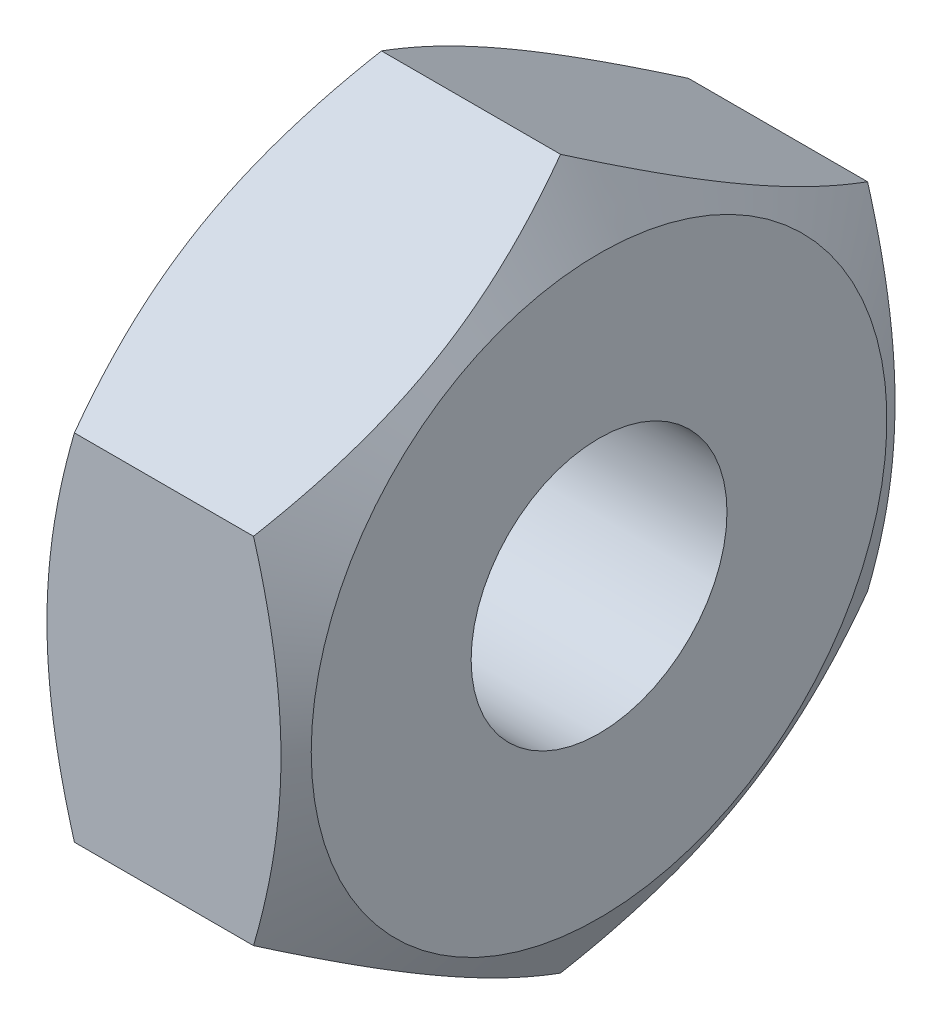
ISO-10303-21;
HEADER;
FILE_DESCRIPTION(('STEP AP214'),'2;1');
FILE_NAME('part.step','',(''),(''),'','','');
FILE_SCHEMA(('AUTOMOTIVE_DESIGN { 1 0 10303 214 1 1 1 1 }'));
ENDSEC;
DATA;
#1=APPLICATION_CONTEXT('core data for automotive mechanical design processes');
#2=APPLICATION_PROTOCOL_DEFINITION('international standard','automotive_design',2000,#1);
#3=PRODUCT_CONTEXT('',#1,'mechanical');
#4=PRODUCT('Part','Part','',(#3));
#5=PRODUCT_RELATED_PRODUCT_CATEGORY('part','',(#4));
#6=PRODUCT_DEFINITION_FORMATION('','',#4);
#7=PRODUCT_DEFINITION_CONTEXT('part definition',#1,'design');
#8=PRODUCT_DEFINITION('design','',#6,#7);
#9=PRODUCT_DEFINITION_SHAPE('','',#8);
#10=(LENGTH_UNIT() NAMED_UNIT(*) SI_UNIT(.MILLI.,.METRE.));
#11=(NAMED_UNIT(*) PLANE_ANGLE_UNIT() SI_UNIT($,.RADIAN.));
#12=(NAMED_UNIT(*) SI_UNIT($,.STERADIAN.) SOLID_ANGLE_UNIT());
#13=UNCERTAINTY_MEASURE_WITH_UNIT(LENGTH_MEASURE(1.E-05),#10,'distance_accuracy_value','');
#14=(GEOMETRIC_REPRESENTATION_CONTEXT(3) GLOBAL_UNCERTAINTY_ASSIGNED_CONTEXT((#13)) GLOBAL_UNIT_ASSIGNED_CONTEXT((#10,
#11,#12)) REPRESENTATION_CONTEXT('',''));
#15=CARTESIAN_POINT('',(0.,0.,0.));
#16=DIRECTION('',(0.,0.,1.));
#17=DIRECTION('',(1.,0.,0.));
#18=AXIS2_PLACEMENT_3D('',#15,#16,#17);
#19=CARTESIAN_POINT('',(10.010176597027,0.,0.));
#20=DIRECTION('',(-1.,0.,0.));
#21=DIRECTION('',(0.,0.,1.));
#22=AXIS2_PLACEMENT_3D('',#19,#20,#21);
#23=PLANE('',#22);
#24=CARTESIAN_POINT('',(10.010176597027,0.,0.));
#25=DIRECTION('',(-1.,0.,0.));
#26=DIRECTION('',(0.,0.,1.));
#27=AXIS2_PLACEMENT_3D('',#24,#25,#26);
#28=CIRCLE('',#27,11.25);
#29=CARTESIAN_POINT('',(10.010176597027,0.,11.25));
#30=VERTEX_POINT('',#29);
#31=EDGE_CURVE('E198',#30,#30,#28,.T.);
#32=ORIENTED_EDGE('',*,*,#31,.F.);
#33=EDGE_LOOP('',(#32));
#34=FACE_BOUND('',#33,.T.);
#35=CARTESIAN_POINT('',(10.010176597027,0.,0.));
#36=DIRECTION('',(-1.,0.,0.));
#37=DIRECTION('',(0.,0.,1.));
#38=AXIS2_PLACEMENT_3D('',#35,#36,#37);
#39=CIRCLE('',#38,5.);
#40=CARTESIAN_POINT('',(10.010176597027,0.,5.));
#41=VERTEX_POINT('',#40);
#42=EDGE_CURVE('E206',#41,#41,#39,.F.);
#43=ORIENTED_EDGE('',*,*,#42,.F.);
#44=EDGE_LOOP('',(#43));
#45=FACE_BOUND('',#44,.T.);
#46=ADVANCED_FACE('F33',(#34,#45),#23,.F.);
#47=CARTESIAN_POINT('',(0.,0.,-11.25));
#48=DIRECTION('',(1.,0.,0.));
#49=DIRECTION('',(0.,0.,-1.));
#50=AXIS2_PLACEMENT_3D('',#47,#48,#49);
#51=PLANE('',#50);
#52=CARTESIAN_POINT('',(0.,0.,0.));
#53=DIRECTION('',(-1.,0.,0.));
#54=DIRECTION('',(0.,0.,1.));
#55=AXIS2_PLACEMENT_3D('',#52,#53,#54);
#56=CIRCLE('',#55,11.25);
#57=CARTESIAN_POINT('',(0.,0.,11.25));
#58=VERTEX_POINT('',#57);
#59=EDGE_CURVE('E196',#58,#58,#56,.T.);
#60=ORIENTED_EDGE('',*,*,#59,.T.);
#61=EDGE_LOOP('',(#60));
#62=FACE_BOUND('',#61,.T.);
#63=CARTESIAN_POINT('',(0.,0.,0.));
#64=DIRECTION('',(1.,0.,0.));
#65=DIRECTION('',(0.,0.,-1.));
#66=AXIS2_PLACEMENT_3D('',#63,#64,#65);
#67=CIRCLE('',#66,5.);
#68=CARTESIAN_POINT('',(0.,0.,-5.));
#69=VERTEX_POINT('',#68);
#70=EDGE_CURVE('E209',#69,#69,#67,.T.);
#71=ORIENTED_EDGE('',*,*,#70,.T.);
#72=EDGE_LOOP('',(#71));
#73=FACE_BOUND('',#72,.T.);
#74=ADVANCED_FACE('F35',(#62,#73),#51,.F.);
#75=CARTESIAN_POINT('',(10.010176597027,0.,0.));
#76=DIRECTION('',(-1.,0.,0.));
#77=DIRECTION('',(0.,0.,1.));
#78=AXIS2_PLACEMENT_3D('',#75,#76,#77);
#79=CONICAL_SURFACE('',#78,11.25,1.04718484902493);
#80=CARTESIAN_POINT('',(3.86354659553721,-18.3148355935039,12.));
#81=CARTESIAN_POINT('',(3.99064930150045,-18.0516434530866,12.));
#82=CARTESIAN_POINT('',(4.11708937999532,-17.7881314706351,12.));
#83=CARTESIAN_POINT('',(4.36849204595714,-17.2604002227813,12.));
#84=CARTESIAN_POINT('',(4.49345461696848,-16.9961809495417,12.));
#85=CARTESIAN_POINT('',(4.86593436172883,-16.2022824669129,12.));
#86=CARTESIAN_POINT('',(5.11100161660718,-15.6714492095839,12.));
#87=CARTESIAN_POINT('',(5.59442396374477,-14.6030255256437,12.));
#88=CARTESIAN_POINT('',(5.83273204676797,-14.0654137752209,12.));
#89=CARTESIAN_POINT('',(6.29903003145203,-12.9857497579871,12.));
#90=CARTESIAN_POINT('',(6.52702047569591,-12.4436977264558,12.));
#91=CARTESIAN_POINT('',(6.97252328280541,-11.3478405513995,12.));
#92=CARTESIAN_POINT('',(7.18988087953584,-10.7939721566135,12.));
#93=CARTESIAN_POINT('',(7.60742376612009,-9.67967702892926,12.));
#94=CARTESIAN_POINT('',(7.80760713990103,-9.11924957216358,12.));
#95=CARTESIAN_POINT('',(8.18537631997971,-7.99213448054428,12.));
#96=CARTESIAN_POINT('',(8.36301069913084,-7.42546326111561,12.));
#97=CARTESIAN_POINT('',(8.68988266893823,-6.28401239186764,12.));
#98=CARTESIAN_POINT('',(8.83912929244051,-5.7092353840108,12.));
#99=CARTESIAN_POINT('',(9.03621869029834,-4.84087707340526,12.));
#100=CARTESIAN_POINT('',(9.0974639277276,-4.55031731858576,12.));
#101=CARTESIAN_POINT('',(9.2100526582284,-3.96727604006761,12.));
#102=CARTESIAN_POINT('',(9.26139637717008,-3.67479456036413,12.));
#103=CARTESIAN_POINT('',(9.35326927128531,-3.08810511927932,12.));
#104=CARTESIAN_POINT('',(9.39379756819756,-2.79389701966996,12.));
#105=CARTESIAN_POINT('',(9.46322106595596,-2.20411251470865,12.));
#106=CARTESIAN_POINT('',(9.49211668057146,-1.90853615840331,12.));
#107=CARTESIAN_POINT('',(9.53750265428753,-1.31827162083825,12.));
#108=CARTESIAN_POINT('',(9.55406889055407,-1.02358931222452,12.));
#109=CARTESIAN_POINT('',(9.57470908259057,-0.433789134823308,12.));
#110=CARTESIAN_POINT('',(9.57878322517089,-0.138671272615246,12.));
#111=CARTESIAN_POINT('',(9.57434291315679,0.451389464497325,12.));
#112=CARTESIAN_POINT('',(9.56583193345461,0.746332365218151,12.));
#113=CARTESIAN_POINT('',(9.53643118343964,1.3356043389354,12.));
#114=CARTESIAN_POINT('',(9.51554075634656,1.6299333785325,12.));
#115=CARTESIAN_POINT('',(9.45018356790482,2.34499314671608,12.));
#116=CARTESIAN_POINT('',(9.39942018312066,2.76515940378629,12.));
#117=CARTESIAN_POINT('',(9.27550632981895,3.60215995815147,12.));
#118=CARTESIAN_POINT('',(9.20235248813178,4.01899374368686,12.));
#119=CARTESIAN_POINT('',(8.95297909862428,5.26524340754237,12.));
#120=CARTESIAN_POINT('',(8.74701586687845,6.08877428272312,12.));
#121=CARTESIAN_POINT('',(8.39237847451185,7.32052156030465,12.));
#122=CARTESIAN_POINT('',(8.2648354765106,7.7351861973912,12.));
#123=CARTESIAN_POINT('',(7.99715987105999,8.56050911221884,12.));
#124=CARTESIAN_POINT('',(7.85702613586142,8.97116702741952,12.));
#125=CARTESIAN_POINT('',(7.56714528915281,9.78642750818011,12.));
#126=CARTESIAN_POINT('',(7.41745706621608,10.1910511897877,12.));
#127=CARTESIAN_POINT('',(7.18650604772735,10.7954453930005,12.));
#128=CARTESIAN_POINT('',(7.10846571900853,10.9964543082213,12.));
#129=CARTESIAN_POINT('',(6.95041947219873,11.3976936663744,12.));
#130=CARTESIAN_POINT('',(6.8704135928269,11.5979241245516,12.));
#131=CARTESIAN_POINT('',(6.7895138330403,11.7977925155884,12.));
#132=B_SPLINE_CURVE_WITH_KNOTS('',3,(#80,#81,#82,#83,#84,#85,#86,#87,#88,#89,#90,#91,#92,#93,
#94,#95,#96,#97,#98,#99,#100,#101,#102,#103,#104,#105,#106,#107,#108,#109,#110,#111,#112,#113,
#114,#115,#116,#117,#118,#119,#120,#121,#122,#123,#124,#125,#126,#127,#128,#129,#130,#131),
.UNSPECIFIED.,.F.,.F.,(4,2,2,2,2,2,2,2,2,2,2,2,2,2,2,2,2,2,2,2,2,2,2,2,2,4),(0.,
0.876825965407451,1.75366168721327,3.50762183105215,5.27172457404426,7.03573443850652,
8.82049054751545,10.6054455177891,12.3864877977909,14.1669624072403,15.0576538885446,
15.948325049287,16.8390685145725,17.7297802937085,18.6149640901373,19.5001346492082,
20.3850608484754,21.2700340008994,22.538976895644,23.8081110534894,26.3512833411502,
27.652692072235,28.954217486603,30.2483777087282,30.895248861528,31.5421072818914),.UNSPECIFIED.);
#133=CARTESIAN_POINT('',(8.5052643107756,6.9284064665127,12.));
#134=VERTEX_POINT('',#133);
#135=CARTESIAN_POINT('',(8.5052643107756,-6.9284064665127,12.));
#136=VERTEX_POINT('',#135);
#137=EDGE_CURVE('E88',#134,#136,#132,.F.);
#138=ORIENTED_EDGE('',*,*,#137,.T.);
#139=CARTESIAN_POINT('',(8.50519764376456,-6.92829099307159,12.0002));
#140=CARTESIAN_POINT('',(8.59311136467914,-7.08059323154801,11.7364125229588));
#141=CARTESIAN_POINT('',(8.67703458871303,-7.233463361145,11.4716414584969));
#142=CARTESIAN_POINT('',(8.83579283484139,-7.54042957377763,10.9399759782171));
#143=CARTESIAN_POINT('',(8.91062486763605,-7.69452604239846,10.6730808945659));
#144=CARTESIAN_POINT('',(9.12003583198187,-8.15929838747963,9.86809519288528));
#145=CARTESIAN_POINT('',(9.23914553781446,-8.4718090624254,9.32682670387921));
#146=CARTESIAN_POINT('',(9.37880845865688,-8.93946674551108,8.51684359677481));
#147=CARTESIAN_POINT('',(9.41859229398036,-9.09321667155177,8.25054872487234));
#148=CARTESIAN_POINT('',(9.48530517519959,-9.40142833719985,7.71672611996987));
#149=CARTESIAN_POINT('',(9.51223397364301,-9.55589009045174,7.44919836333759));
#150=CARTESIAN_POINT('',(9.55254699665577,-9.86507102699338,6.91369698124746));
#151=CARTESIAN_POINT('',(9.56594731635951,-10.019789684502,6.64572426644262));
#152=CARTESIAN_POINT('',(9.57891784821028,-10.329370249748,6.10953072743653));
#153=CARTESIAN_POINT('',(9.57848848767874,-10.4842321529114,5.84130991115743));
#154=CARTESIAN_POINT('',(9.56476570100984,-10.773745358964,5.33987303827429));
#155=CARTESIAN_POINT('',(9.55314506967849,-10.908417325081,5.10662119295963));
#156=CARTESIAN_POINT('',(9.51966371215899,-11.1774514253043,4.64065413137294));
#157=CARTESIAN_POINT('',(9.49780226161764,-11.3118135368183,4.40793895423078));
#158=CARTESIAN_POINT('',(9.44422038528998,-11.5801549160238,3.94317168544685));
#159=CARTESIAN_POINT('',(9.41249181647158,-11.7141337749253,3.71112030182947));
#160=CARTESIAN_POINT('',(9.33973236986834,-11.9814632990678,3.24810556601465));
#161=CARTESIAN_POINT('',(9.2987008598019,-12.114813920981,3.01714228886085));
#162=CARTESIAN_POINT('',(9.16061459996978,-12.5196072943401,2.31604016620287));
#163=CARTESIAN_POINT('',(9.04979264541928,-12.7898777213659,1.84793178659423));
#164=CARTESIAN_POINT('',(8.79827501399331,-13.3263882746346,0.918695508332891));
#165=CARTESIAN_POINT('',(8.65763840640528,-13.5926352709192,0.457555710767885));
#166=CARTESIAN_POINT('',(8.50502162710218,-13.8569284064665,-0.000199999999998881));
#167=B_SPLINE_CURVE_WITH_KNOTS('',3,(#139,#140,#141,#142,#143,#144,#145,#146,#147,#148,#149,
#150,#151,#152,#153,#154,#155,#156,#157,#158,#159,#160,#161,#162,#163,#164,#165,#166),
.UNSPECIFIED.,.F.,.F.,(4,2,2,2,2,2,2,2,2,2,2,2,2,4),(0.,0.951016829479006,1.90234552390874,
3.8090522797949,4.73900400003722,5.66897362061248,6.59783552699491,7.52666873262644,
8.33523966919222,9.14386780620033,9.95316505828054,10.7625173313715,12.4168152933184,
14.0678658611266),.UNSPECIFIED.);
#168=CARTESIAN_POINT('',(8.50508829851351,-13.8568129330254,0.));
#169=VERTEX_POINT('',#168);
#170=EDGE_CURVE('E188',#136,#169,#167,.T.);
#171=ORIENTED_EDGE('',*,*,#170,.T.);
#172=CARTESIAN_POINT('',(8.50502162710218,-13.8569284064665,0.000199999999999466));
#173=CARTESIAN_POINT('',(8.59294257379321,-13.7046236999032,-0.26359175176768));
#174=CARTESIAN_POINT('',(8.67687320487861,-13.5517510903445,-0.528367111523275));
#175=CARTESIAN_POINT('',(8.83564660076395,-13.2447798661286,-1.06004127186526));
#176=CARTESIAN_POINT('',(8.91048637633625,-13.0906808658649,-1.32694074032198));
#177=CARTESIAN_POINT('',(9.11992112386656,-12.6259006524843,-2.13194006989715));
#178=CARTESIAN_POINT('',(9.23904730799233,-12.3133845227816,-2.67321800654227));
#179=CARTESIAN_POINT('',(9.37873491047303,-11.8457184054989,-3.48321572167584));
#180=CARTESIAN_POINT('',(9.41852685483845,-11.6919657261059,-3.74951536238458));
#181=CARTESIAN_POINT('',(9.48525586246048,-11.383748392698,-4.28334778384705));
#182=CARTESIAN_POINT('',(9.51219267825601,-11.2292837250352,-4.55088058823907));
#183=CARTESIAN_POINT('',(9.55252143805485,-10.920096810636,-5.08639232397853));
#184=CARTESIAN_POINT('',(9.56592947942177,-10.7653750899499,-5.35437034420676));
#185=CARTESIAN_POINT('',(9.57891496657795,-10.4557882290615,-5.8905747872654));
#186=CARTESIAN_POINT('',(9.57849283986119,-10.3009230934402,-6.15880120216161));
#187=CARTESIAN_POINT('',(9.56478324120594,-10.0114097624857,-6.66023829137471));
#188=CARTESIAN_POINT('',(9.55316911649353,-9.8767409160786,-6.89348473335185));
#189=CARTESIAN_POINT('',(9.51970107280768,-9.60771292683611,-7.35944121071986));
#190=CARTESIAN_POINT('',(9.49784642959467,-9.47335380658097,-7.59215120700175));
#191=CARTESIAN_POINT('',(9.44427834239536,-9.20501829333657,-8.05690831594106));
#192=CARTESIAN_POINT('',(9.41255675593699,-9.07104230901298,-8.28895472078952));
#193=CARTESIAN_POINT('',(9.33981132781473,-8.80371842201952,-8.75195969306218));
#194=CARTESIAN_POINT('',(9.29878685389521,-8.67037056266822,-8.98291818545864));
#195=CARTESIAN_POINT('',(9.16072197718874,-8.26558560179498,-9.6840057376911));
#196=CARTESIAN_POINT('',(9.04991430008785,-7.99532067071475,-10.1521045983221));
#197=CARTESIAN_POINT('',(8.79842450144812,-7.45882079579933,-11.0813223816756));
#198=CARTESIAN_POINT('',(8.65780144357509,-7.19257898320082,-11.5424532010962));
#199=CARTESIAN_POINT('',(8.50519764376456,-6.92829099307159,-12.0002));
#200=B_SPLINE_CURVE_WITH_KNOTS('',3,(#172,#173,#174,#175,#176,#177,#178,#179,#180,#181,#182,
#183,#184,#185,#186,#187,#188,#189,#190,#191,#192,#193,#194,#195,#196,#197,#198,#199),
.UNSPECIFIED.,.F.,.F.,(4,2,2,2,2,2,2,2,2,2,2,2,2,4),(0.,0.951037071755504,1.90238601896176,
3.80913427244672,4.73910549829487,5.66909462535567,6.59797588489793,7.52682843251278,
8.33537983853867,9.14398843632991,9.95326609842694,10.7625987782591,12.4168557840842,
14.0678658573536),.UNSPECIFIED.);
#201=CARTESIAN_POINT('',(8.5052643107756,-6.9284064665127,-12.));
#202=VERTEX_POINT('',#201);
#203=EDGE_CURVE('E182',#169,#202,#200,.T.);
#204=ORIENTED_EDGE('',*,*,#203,.T.);
#205=CARTESIAN_POINT('',(3.86354659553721,-18.3148355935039,-12.));
#206=CARTESIAN_POINT('',(3.99064930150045,-18.0516434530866,-12.));
#207=CARTESIAN_POINT('',(4.11708937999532,-17.7881314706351,-12.));
#208=CARTESIAN_POINT('',(4.36849204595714,-17.2604002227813,-12.));
#209=CARTESIAN_POINT('',(4.49345461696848,-16.9961809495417,-12.));
#210=CARTESIAN_POINT('',(4.86593436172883,-16.2022824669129,-12.));
#211=CARTESIAN_POINT('',(5.11100161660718,-15.6714492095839,-12.));
#212=CARTESIAN_POINT('',(5.59442396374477,-14.6030255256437,-12.));
#213=CARTESIAN_POINT('',(5.83273204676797,-14.0654137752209,-12.));
#214=CARTESIAN_POINT('',(6.29903003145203,-12.9857497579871,-12.));
#215=CARTESIAN_POINT('',(6.52702047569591,-12.4436977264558,-12.));
#216=CARTESIAN_POINT('',(6.97252328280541,-11.3478405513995,-12.));
#217=CARTESIAN_POINT('',(7.18988087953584,-10.7939721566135,-12.));
#218=CARTESIAN_POINT('',(7.60742376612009,-9.67967702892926,-12.));
#219=CARTESIAN_POINT('',(7.80760713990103,-9.11924957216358,-12.));
#220=CARTESIAN_POINT('',(8.18537631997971,-7.99213448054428,-12.));
#221=CARTESIAN_POINT('',(8.36301069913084,-7.42546326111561,-12.));
#222=CARTESIAN_POINT('',(8.68988266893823,-6.28401239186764,-12.));
#223=CARTESIAN_POINT('',(8.83912929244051,-5.7092353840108,-12.));
#224=CARTESIAN_POINT('',(9.03621869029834,-4.84087707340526,-12.));
#225=CARTESIAN_POINT('',(9.0974639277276,-4.55031731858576,-12.));
#226=CARTESIAN_POINT('',(9.2100526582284,-3.96727604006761,-12.));
#227=CARTESIAN_POINT('',(9.26139637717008,-3.67479456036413,-12.));
#228=CARTESIAN_POINT('',(9.35326927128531,-3.08810511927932,-12.));
#229=CARTESIAN_POINT('',(9.39379756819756,-2.79389701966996,-12.));
#230=CARTESIAN_POINT('',(9.46322106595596,-2.20411251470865,-12.));
#231=CARTESIAN_POINT('',(9.49211668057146,-1.90853615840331,-12.));
#232=CARTESIAN_POINT('',(9.53750265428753,-1.31827162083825,-12.));
#233=CARTESIAN_POINT('',(9.55406889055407,-1.02358931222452,-12.));
#234=CARTESIAN_POINT('',(9.57470908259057,-0.433789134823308,-12.));
#235=CARTESIAN_POINT('',(9.57878322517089,-0.138671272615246,-12.));
#236=CARTESIAN_POINT('',(9.57434291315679,0.451389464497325,-12.));
#237=CARTESIAN_POINT('',(9.56583193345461,0.746332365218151,-12.));
#238=CARTESIAN_POINT('',(9.53643118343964,1.3356043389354,-12.));
#239=CARTESIAN_POINT('',(9.51554075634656,1.6299333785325,-12.));
#240=CARTESIAN_POINT('',(9.45018356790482,2.34499314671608,-12.));
#241=CARTESIAN_POINT('',(9.39942018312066,2.76515940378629,-12.));
#242=CARTESIAN_POINT('',(9.27550632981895,3.60215995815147,-12.));
#243=CARTESIAN_POINT('',(9.20235248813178,4.01899374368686,-12.));
#244=CARTESIAN_POINT('',(8.95297909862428,5.26524340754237,-12.));
#245=CARTESIAN_POINT('',(8.74701586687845,6.08877428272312,-12.));
#246=CARTESIAN_POINT('',(8.39237847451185,7.32052156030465,-12.));
#247=CARTESIAN_POINT('',(8.2648354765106,7.7351861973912,-12.));
#248=CARTESIAN_POINT('',(7.99715987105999,8.56050911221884,-12.));
#249=CARTESIAN_POINT('',(7.85702613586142,8.97116702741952,-12.));
#250=CARTESIAN_POINT('',(7.56714528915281,9.78642750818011,-12.));
#251=CARTESIAN_POINT('',(7.41745706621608,10.1910511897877,-12.));
#252=CARTESIAN_POINT('',(7.18650604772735,10.7954453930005,-12.));
#253=CARTESIAN_POINT('',(7.10846571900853,10.9964543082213,-12.));
#254=CARTESIAN_POINT('',(6.95041947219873,11.3976936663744,-12.));
#255=CARTESIAN_POINT('',(6.8704135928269,11.5979241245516,-12.));
#256=CARTESIAN_POINT('',(6.7895138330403,11.7977925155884,-12.));
#257=B_SPLINE_CURVE_WITH_KNOTS('',3,(#205,#206,#207,#208,#209,#210,#211,#212,#213,#214,#215,
#216,#217,#218,#219,#220,#221,#222,#223,#224,#225,#226,#227,#228,#229,#230,#231,#232,#233,#234,
#235,#236,#237,#238,#239,#240,#241,#242,#243,#244,#245,#246,#247,#248,#249,#250,#251,#252,#253,
#254,#255,#256),.UNSPECIFIED.,.F.,.F.,(4,2,2,2,2,2,2,2,2,2,2,2,2,2,2,2,2,2,2,2,2,2,2,2,2,4),(0.,
0.876825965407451,1.75366168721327,3.50762183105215,5.27172457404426,7.03573443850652,
8.82049054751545,10.6054455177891,12.3864877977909,14.1669624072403,15.0576538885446,
15.948325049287,16.8390685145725,17.7297802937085,18.6149640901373,19.5001346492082,
20.3850608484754,21.2700340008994,22.538976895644,23.8081110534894,26.3512833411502,
27.652692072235,28.954217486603,30.2483777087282,30.895248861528,31.5421072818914),.UNSPECIFIED.);
#258=CARTESIAN_POINT('',(8.5052643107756,6.9284064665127,-12.));
#259=VERTEX_POINT('',#258);
#260=EDGE_CURVE('E111',#202,#259,#257,.T.);
#261=ORIENTED_EDGE('',*,*,#260,.T.);
#262=CARTESIAN_POINT('',(8.50519764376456,6.92829099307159,-12.0002));
#263=CARTESIAN_POINT('',(8.59311136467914,7.08059323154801,-11.7364125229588));
#264=CARTESIAN_POINT('',(8.67703458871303,7.233463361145,-11.4716414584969));
#265=CARTESIAN_POINT('',(8.83579283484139,7.54042957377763,-10.9399759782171));
#266=CARTESIAN_POINT('',(8.91062486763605,7.69452604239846,-10.6730808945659));
#267=CARTESIAN_POINT('',(9.12003583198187,8.15929838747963,-9.86809519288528));
#268=CARTESIAN_POINT('',(9.23914553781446,8.4718090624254,-9.32682670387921));
#269=CARTESIAN_POINT('',(9.37880845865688,8.93946674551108,-8.51684359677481));
#270=CARTESIAN_POINT('',(9.41859229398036,9.09321667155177,-8.25054872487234));
#271=CARTESIAN_POINT('',(9.48530517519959,9.40142833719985,-7.71672611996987));
#272=CARTESIAN_POINT('',(9.51223397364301,9.55589009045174,-7.44919836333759));
#273=CARTESIAN_POINT('',(9.55254699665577,9.86507102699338,-6.91369698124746));
#274=CARTESIAN_POINT('',(9.56594731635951,10.019789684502,-6.64572426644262));
#275=CARTESIAN_POINT('',(9.57891784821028,10.329370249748,-6.10953072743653));
#276=CARTESIAN_POINT('',(9.57848848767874,10.4842321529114,-5.84130991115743));
#277=CARTESIAN_POINT('',(9.56476570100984,10.773745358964,-5.33987303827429));
#278=CARTESIAN_POINT('',(9.55314506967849,10.908417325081,-5.10662119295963));
#279=CARTESIAN_POINT('',(9.51966371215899,11.1774514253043,-4.64065413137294));
#280=CARTESIAN_POINT('',(9.49780226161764,11.3118135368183,-4.40793895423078));
#281=CARTESIAN_POINT('',(9.44422038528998,11.5801549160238,-3.94317168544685));
#282=CARTESIAN_POINT('',(9.41249181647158,11.7141337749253,-3.71112030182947));
#283=CARTESIAN_POINT('',(9.33973236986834,11.9814632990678,-3.24810556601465));
#284=CARTESIAN_POINT('',(9.2987008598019,12.114813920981,-3.01714228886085));
#285=CARTESIAN_POINT('',(9.16061459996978,12.5196072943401,-2.31604016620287));
#286=CARTESIAN_POINT('',(9.04979264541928,12.7898777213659,-1.84793178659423));
#287=CARTESIAN_POINT('',(8.79827501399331,13.3263882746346,-0.918695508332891));
#288=CARTESIAN_POINT('',(8.65763840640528,13.5926352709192,-0.457555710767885));
#289=CARTESIAN_POINT('',(8.50502162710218,13.8569284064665,0.000199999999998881));
#290=B_SPLINE_CURVE_WITH_KNOTS('',3,(#262,#263,#264,#265,#266,#267,#268,#269,#270,#271,#272,
#273,#274,#275,#276,#277,#278,#279,#280,#281,#282,#283,#284,#285,#286,#287,#288,#289),
.UNSPECIFIED.,.F.,.F.,(4,2,2,2,2,2,2,2,2,2,2,2,2,4),(0.,0.951016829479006,1.90234552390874,
3.8090522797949,4.73900400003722,5.66897362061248,6.59783552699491,7.52666873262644,
8.33523966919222,9.14386780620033,9.95316505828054,10.7625173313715,12.4168152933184,
14.0678658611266),.UNSPECIFIED.);
#291=CARTESIAN_POINT('',(8.50508829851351,13.8568129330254,0.));
#292=VERTEX_POINT('',#291);
#293=EDGE_CURVE('E109',#259,#292,#290,.T.);
#294=ORIENTED_EDGE('',*,*,#293,.T.);
#295=CARTESIAN_POINT('',(8.50502162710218,13.8569284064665,-0.000199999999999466));
#296=CARTESIAN_POINT('',(8.59294257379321,13.7046236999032,0.26359175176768));
#297=CARTESIAN_POINT('',(8.67687320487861,13.5517510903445,0.528367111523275));
#298=CARTESIAN_POINT('',(8.83564660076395,13.2447798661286,1.06004127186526));
#299=CARTESIAN_POINT('',(8.91048637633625,13.0906808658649,1.32694074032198));
#300=CARTESIAN_POINT('',(9.11992112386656,12.6259006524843,2.13194006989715));
#301=CARTESIAN_POINT('',(9.23904730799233,12.3133845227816,2.67321800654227));
#302=CARTESIAN_POINT('',(9.37873491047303,11.8457184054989,3.48321572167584));
#303=CARTESIAN_POINT('',(9.41852685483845,11.6919657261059,3.74951536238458));
#304=CARTESIAN_POINT('',(9.48525586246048,11.383748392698,4.28334778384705));
#305=CARTESIAN_POINT('',(9.51219267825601,11.2292837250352,4.55088058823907));
#306=CARTESIAN_POINT('',(9.55252143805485,10.920096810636,5.08639232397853));
#307=CARTESIAN_POINT('',(9.56592947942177,10.7653750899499,5.35437034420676));
#308=CARTESIAN_POINT('',(9.57891496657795,10.4557882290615,5.8905747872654));
#309=CARTESIAN_POINT('',(9.57849283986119,10.3009230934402,6.15880120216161));
#310=CARTESIAN_POINT('',(9.56478324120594,10.0114097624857,6.66023829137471));
#311=CARTESIAN_POINT('',(9.55316911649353,9.8767409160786,6.89348473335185));
#312=CARTESIAN_POINT('',(9.51970107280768,9.60771292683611,7.35944121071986));
#313=CARTESIAN_POINT('',(9.49784642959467,9.47335380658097,7.59215120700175));
#314=CARTESIAN_POINT('',(9.44427834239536,9.20501829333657,8.05690831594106));
#315=CARTESIAN_POINT('',(9.41255675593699,9.07104230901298,8.28895472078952));
#316=CARTESIAN_POINT('',(9.33981132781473,8.80371842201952,8.75195969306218));
#317=CARTESIAN_POINT('',(9.29878685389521,8.67037056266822,8.98291818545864));
#318=CARTESIAN_POINT('',(9.16072197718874,8.26558560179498,9.6840057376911));
#319=CARTESIAN_POINT('',(9.04991430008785,7.99532067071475,10.1521045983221));
#320=CARTESIAN_POINT('',(8.79842450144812,7.45882079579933,11.0813223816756));
#321=CARTESIAN_POINT('',(8.65780144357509,7.19257898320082,11.5424532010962));
#322=CARTESIAN_POINT('',(8.50519764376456,6.92829099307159,12.0002));
#323=B_SPLINE_CURVE_WITH_KNOTS('',3,(#295,#296,#297,#298,#299,#300,#301,#302,#303,#304,#305,
#306,#307,#308,#309,#310,#311,#312,#313,#314,#315,#316,#317,#318,#319,#320,#321,#322),
.UNSPECIFIED.,.F.,.F.,(4,2,2,2,2,2,2,2,2,2,2,2,2,4),(0.,0.951037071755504,1.90238601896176,
3.80913427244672,4.73910549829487,5.66909462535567,6.59797588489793,7.52682843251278,
8.33537983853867,9.14398843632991,9.95326609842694,10.7625987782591,12.4168557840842,
14.0678658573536),.UNSPECIFIED.);
#324=EDGE_CURVE('E93',#292,#134,#323,.T.);
#325=ORIENTED_EDGE('',*,*,#324,.T.);
#326=EDGE_LOOP('',(#138,#171,#204,#261,#294,#325));
#327=FACE_BOUND('',#326,.T.);
#328=ORIENTED_EDGE('',*,*,#31,.T.);
#329=EDGE_LOOP('',(#328));
#330=FACE_BOUND('',#329,.T.);
#331=ADVANCED_FACE('F106',(#327,#330),#79,.T.);
#332=CARTESIAN_POINT('',(25.,-13.8568129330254,0.));
#333=DIRECTION('',(0.,0.866019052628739,-0.500011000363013));
#334=DIRECTION('',(0.,0.500011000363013,0.866019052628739));
#335=AXIS2_PLACEMENT_3D('',#332,#333,#334);
#336=PLANE('',#335);
#337=DIRECTION('',(-1.,0.,0.));
#338=VECTOR('',#337,1.);
#339=CARTESIAN_POINT('',(25.,-6.9284064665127,12.));
#340=LINE('',#339,#338);
#341=CARTESIAN_POINT('',(1.50491228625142,-6.9284064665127,12.));
#342=VERTEX_POINT('',#341);
#343=EDGE_CURVE('E53',#136,#342,#340,.T.);
#344=ORIENTED_EDGE('',*,*,#343,.T.);
#345=CARTESIAN_POINT('',(1.50515496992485,-13.8569284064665,-0.000199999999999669));
#346=CARTESIAN_POINT('',(1.41723402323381,-13.7046236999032,0.26359175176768));
#347=CARTESIAN_POINT('',(1.33330339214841,-13.5517510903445,0.528367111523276));
#348=CARTESIAN_POINT('',(1.17452999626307,-13.2447798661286,1.06004127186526));
#349=CARTESIAN_POINT('',(1.09969022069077,-13.0906808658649,1.32694074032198));
#350=CARTESIAN_POINT('',(0.890255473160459,-12.6259006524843,2.13194006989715));
#351=CARTESIAN_POINT('',(0.771129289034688,-12.3133845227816,2.67321800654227));
#352=CARTESIAN_POINT('',(0.631441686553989,-11.8457184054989,3.48321572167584));
#353=CARTESIAN_POINT('',(0.591649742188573,-11.6919657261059,3.74951536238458));
#354=CARTESIAN_POINT('',(0.524920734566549,-11.383748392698,4.28334778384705));
#355=CARTESIAN_POINT('',(0.497983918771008,-11.2292837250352,4.55088058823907));
#356=CARTESIAN_POINT('',(0.457655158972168,-10.920096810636,5.08639232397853));
#357=CARTESIAN_POINT('',(0.444247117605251,-10.7653750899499,5.35437034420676));
#358=CARTESIAN_POINT('',(0.431261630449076,-10.4557882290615,5.8905747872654));
#359=CARTESIAN_POINT('',(0.431683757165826,-10.3009230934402,6.15880120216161));
#360=CARTESIAN_POINT('',(0.445393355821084,-10.0114097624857,6.66023829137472));
#361=CARTESIAN_POINT('',(0.457007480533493,-9.8767409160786,6.89348473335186));
#362=CARTESIAN_POINT('',(0.490475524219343,-9.60771292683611,7.35944121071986));
#363=CARTESIAN_POINT('',(0.512330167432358,-9.47335380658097,7.59215120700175));
#364=CARTESIAN_POINT('',(0.565898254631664,-9.20501829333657,8.05690831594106));
#365=CARTESIAN_POINT('',(0.597619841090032,-9.07104230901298,8.28895472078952));
#366=CARTESIAN_POINT('',(0.670365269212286,-8.80371842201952,8.75195969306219));
#367=CARTESIAN_POINT('',(0.71138974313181,-8.67037056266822,8.98291818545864));
#368=CARTESIAN_POINT('',(0.849454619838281,-8.26558560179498,9.6840057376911));
#369=CARTESIAN_POINT('',(0.960262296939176,-7.99532067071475,10.1521045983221));
#370=CARTESIAN_POINT('',(1.21175209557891,-7.45882079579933,11.0813223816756));
#371=CARTESIAN_POINT('',(1.35237515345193,-7.19257898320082,11.5424532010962));
#372=CARTESIAN_POINT('',(1.50497895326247,-6.92829099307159,12.0002));
#373=B_SPLINE_CURVE_WITH_KNOTS('',3,(#345,#346,#347,#348,#349,#350,#351,#352,#353,#354,#355,
#356,#357,#358,#359,#360,#361,#362,#363,#364,#365,#366,#367,#368,#369,#370,#371,#372),
.UNSPECIFIED.,.F.,.F.,(4,2,2,2,2,2,2,2,2,2,2,2,2,4),(0.,0.951037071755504,1.90238601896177,
3.80913427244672,4.73910549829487,5.66909462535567,6.59797588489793,7.52682843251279,
8.33537983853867,9.14398843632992,9.95326609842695,10.7625987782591,12.4168557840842,
14.0678658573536),.UNSPECIFIED.);
#374=CARTESIAN_POINT('',(1.50508829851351,-13.8568129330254,0.));
#375=VERTEX_POINT('',#374);
#376=EDGE_CURVE('E11',#375,#342,#373,.T.);
#377=ORIENTED_EDGE('',*,*,#376,.F.);
#378=DIRECTION('',(-1.,0.,0.));
#379=VECTOR('',#378,1.);
#380=CARTESIAN_POINT('',(25.,-13.8568129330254,0.));
#381=LINE('',#380,#379);
#382=EDGE_CURVE('E94',#169,#375,#381,.T.);
#383=ORIENTED_EDGE('',*,*,#382,.F.);
#384=ORIENTED_EDGE('',*,*,#170,.F.);
#385=EDGE_LOOP('',(#344,#377,#383,#384));
#386=FACE_BOUND('',#385,.T.);
#387=ADVANCED_FACE('F158',(#386),#336,.F.);
#388=CARTESIAN_POINT('',(25.,-6.9284064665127,-12.));
#389=DIRECTION('',(0.,0.866019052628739,0.500011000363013));
#390=DIRECTION('',(0.,-0.500011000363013,0.866019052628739));
#391=AXIS2_PLACEMENT_3D('',#388,#389,#390);
#392=PLANE('',#391);
#393=ORIENTED_EDGE('',*,*,#382,.T.);
#394=CARTESIAN_POINT('',(1.50497895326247,-6.92829099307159,-12.0002));
#395=CARTESIAN_POINT('',(1.41706523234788,-7.08059323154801,-11.7364125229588));
#396=CARTESIAN_POINT('',(1.33314200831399,-7.23346336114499,-11.4716414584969));
#397=CARTESIAN_POINT('',(1.17438376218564,-7.54042957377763,-10.9399759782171));
#398=CARTESIAN_POINT('',(1.09955172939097,-7.69452604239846,-10.6730808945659));
#399=CARTESIAN_POINT('',(0.890140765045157,-8.15929838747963,-9.86809519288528));
#400=CARTESIAN_POINT('',(0.771031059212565,-8.4718090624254,-9.32682670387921));
#401=CARTESIAN_POINT('',(0.631368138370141,-8.93946674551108,-8.51684359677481));
#402=CARTESIAN_POINT('',(0.59158430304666,-9.09321667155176,-8.25054872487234));
#403=CARTESIAN_POINT('',(0.524871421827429,-9.40142833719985,-7.71672611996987));
#404=CARTESIAN_POINT('',(0.497942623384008,-9.55589009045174,-7.44919836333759));
#405=CARTESIAN_POINT('',(0.457629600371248,-9.86507102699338,-6.91369698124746));
#406=CARTESIAN_POINT('',(0.444229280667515,-10.019789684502,-6.64572426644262));
#407=CARTESIAN_POINT('',(0.431258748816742,-10.329370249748,-6.10953072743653));
#408=CARTESIAN_POINT('',(0.431688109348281,-10.4842321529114,-5.84130991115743));
#409=CARTESIAN_POINT('',(0.445410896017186,-10.773745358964,-5.33987303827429));
#410=CARTESIAN_POINT('',(0.457031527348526,-10.908417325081,-5.10662119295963));
#411=CARTESIAN_POINT('',(0.49051288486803,-11.1774514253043,-4.64065413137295));
#412=CARTESIAN_POINT('',(0.512374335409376,-11.3118135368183,-4.40793895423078));
#413=CARTESIAN_POINT('',(0.565956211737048,-11.5801549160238,-3.94317168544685));
#414=CARTESIAN_POINT('',(0.597684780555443,-11.7141337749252,-3.71112030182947));
#415=CARTESIAN_POINT('',(0.670444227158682,-11.9814632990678,-3.24810556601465));
#416=CARTESIAN_POINT('',(0.711475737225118,-12.114813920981,-3.01714228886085));
#417=CARTESIAN_POINT('',(0.849561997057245,-12.5196072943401,-2.31604016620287));
#418=CARTESIAN_POINT('',(0.960383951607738,-12.7898777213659,-1.84793178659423));
#419=CARTESIAN_POINT('',(1.21190158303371,-13.3263882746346,-0.918695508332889));
#420=CARTESIAN_POINT('',(1.35253819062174,-13.5926352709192,-0.457555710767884));
#421=CARTESIAN_POINT('',(1.50515496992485,-13.8569284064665,0.000199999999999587));
#422=B_SPLINE_CURVE_WITH_KNOTS('',3,(#394,#395,#396,#397,#398,#399,#400,#401,#402,#403,#404,
#405,#406,#407,#408,#409,#410,#411,#412,#413,#414,#415,#416,#417,#418,#419,#420,#421),
.UNSPECIFIED.,.F.,.F.,(4,2,2,2,2,2,2,2,2,2,2,2,2,4),(0.,0.951016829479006,1.90234552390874,
3.8090522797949,4.73900400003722,5.66897362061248,6.59783552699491,7.52666873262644,
8.33523966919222,9.14386780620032,9.95316505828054,10.7625173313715,12.4168152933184,
14.0678658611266),.UNSPECIFIED.);
#423=CARTESIAN_POINT('',(1.50491228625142,-6.9284064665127,-12.));
#424=VERTEX_POINT('',#423);
#425=EDGE_CURVE('E46',#424,#375,#422,.T.);
#426=ORIENTED_EDGE('',*,*,#425,.F.);
#427=DIRECTION('',(-1.,0.,0.));
#428=VECTOR('',#427,1.);
#429=CARTESIAN_POINT('',(25.,-6.9284064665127,-12.));
#430=LINE('',#429,#428);
#431=EDGE_CURVE('E217',#202,#424,#430,.T.);
#432=ORIENTED_EDGE('',*,*,#431,.F.);
#433=ORIENTED_EDGE('',*,*,#203,.F.);
#434=EDGE_LOOP('',(#393,#426,#432,#433));
#435=FACE_BOUND('',#434,.T.);
#436=ADVANCED_FACE('F174',(#435),#392,.F.);
#437=CARTESIAN_POINT('',(25.,6.9284064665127,-12.));
#438=DIRECTION('',(0.,0.,1.));
#439=DIRECTION('',(1.,0.,0.));
#440=AXIS2_PLACEMENT_3D('',#437,#438,#439);
#441=PLANE('',#440);
#442=ORIENTED_EDGE('',*,*,#431,.T.);
#443=CARTESIAN_POINT('',(6.14663000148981,-18.3148355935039,-12.));
#444=CARTESIAN_POINT('',(6.01952729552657,-18.0516434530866,-12.));
#445=CARTESIAN_POINT('',(5.89308721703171,-17.7881314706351,-12.));
#446=CARTESIAN_POINT('',(5.64168455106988,-17.2604002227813,-12.));
#447=CARTESIAN_POINT('',(5.51672198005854,-16.9961809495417,-12.));
#448=CARTESIAN_POINT('',(5.1442422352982,-16.2022824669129,-12.));
#449=CARTESIAN_POINT('',(4.89917498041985,-15.6714492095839,-12.));
#450=CARTESIAN_POINT('',(4.41575263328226,-14.6030255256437,-12.));
#451=CARTESIAN_POINT('',(4.17744455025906,-14.0654137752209,-12.));
#452=CARTESIAN_POINT('',(3.711146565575,-12.9857497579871,-12.));
#453=CARTESIAN_POINT('',(3.48315612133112,-12.4436977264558,-12.));
#454=CARTESIAN_POINT('',(3.03765331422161,-11.3478405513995,-12.));
#455=CARTESIAN_POINT('',(2.82029571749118,-10.7939721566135,-12.));
#456=CARTESIAN_POINT('',(2.40275283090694,-9.67967702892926,-12.));
#457=CARTESIAN_POINT('',(2.202569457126,-9.11924957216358,-12.));
#458=CARTESIAN_POINT('',(1.82480027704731,-7.99213448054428,-12.));
#459=CARTESIAN_POINT('',(1.64716589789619,-7.42546326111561,-12.));
#460=CARTESIAN_POINT('',(1.32029392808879,-6.28401239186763,-12.));
#461=CARTESIAN_POINT('',(1.17104730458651,-5.70923538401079,-12.));
#462=CARTESIAN_POINT('',(0.973957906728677,-4.84087707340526,-12.));
#463=CARTESIAN_POINT('',(0.912712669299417,-4.55031731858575,-12.));
#464=CARTESIAN_POINT('',(0.800123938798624,-3.9672760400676,-12.));
#465=CARTESIAN_POINT('',(0.748780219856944,-3.67479456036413,-12.));
#466=CARTESIAN_POINT('',(0.656907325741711,-3.08810511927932,-12.));
#467=CARTESIAN_POINT('',(0.616379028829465,-2.79389701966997,-12.));
#468=CARTESIAN_POINT('',(0.546955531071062,-2.20411251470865,-12.));
#469=CARTESIAN_POINT('',(0.51805991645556,-1.90853615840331,-12.));
#470=CARTESIAN_POINT('',(0.472673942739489,-1.31827162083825,-12.));
#471=CARTESIAN_POINT('',(0.45610770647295,-1.02358931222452,-12.));
#472=CARTESIAN_POINT('',(0.435467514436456,-0.433789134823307,-12.));
#473=CARTESIAN_POINT('',(0.431393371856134,-0.138671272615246,-12.));
#474=CARTESIAN_POINT('',(0.435833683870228,0.451389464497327,-12.));
#475=CARTESIAN_POINT('',(0.444344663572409,0.746332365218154,-12.));
#476=CARTESIAN_POINT('',(0.473745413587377,1.3356043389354,-12.));
#477=CARTESIAN_POINT('',(0.494635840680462,1.6299333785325,-12.));
#478=CARTESIAN_POINT('',(0.559993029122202,2.34499314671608,-12.));
#479=CARTESIAN_POINT('',(0.610756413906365,2.76515940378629,-12.));
#480=CARTESIAN_POINT('',(0.734670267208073,3.60215995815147,-12.));
#481=CARTESIAN_POINT('',(0.807824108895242,4.01899374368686,-12.));
#482=CARTESIAN_POINT('',(1.05719749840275,5.26524340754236,-12.));
#483=CARTESIAN_POINT('',(1.26316073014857,6.08877428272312,-12.));
#484=CARTESIAN_POINT('',(1.61779812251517,7.32052156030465,-12.));
#485=CARTESIAN_POINT('',(1.74534112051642,7.7351861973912,-12.));
#486=CARTESIAN_POINT('',(2.01301672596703,8.56050911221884,-12.));
#487=CARTESIAN_POINT('',(2.1531504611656,8.97116702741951,-12.));
#488=CARTESIAN_POINT('',(2.44303130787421,9.7864275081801,-12.));
#489=CARTESIAN_POINT('',(2.59271953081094,10.1910511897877,-12.));
#490=CARTESIAN_POINT('',(2.82367054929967,10.7954453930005,-12.));
#491=CARTESIAN_POINT('',(2.90171087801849,10.9964543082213,-12.));
#492=CARTESIAN_POINT('',(3.05975712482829,11.3976936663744,-12.));
#493=CARTESIAN_POINT('',(3.13976300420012,11.5979241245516,-12.));
#494=CARTESIAN_POINT('',(3.22066276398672,11.7977925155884,-12.));
#495=B_SPLINE_CURVE_WITH_KNOTS('',3,(#443,#444,#445,#446,#447,#448,#449,#450,#451,#452,#453,
#454,#455,#456,#457,#458,#459,#460,#461,#462,#463,#464,#465,#466,#467,#468,#469,#470,#471,#472,
#473,#474,#475,#476,#477,#478,#479,#480,#481,#482,#483,#484,#485,#486,#487,#488,#489,#490,#491,
#492,#493,#494),.UNSPECIFIED.,.F.,.F.,(4,2,2,2,2,2,2,2,2,2,2,2,2,2,2,2,2,2,2,2,2,2,2,2,2,4),(0.,
0.876825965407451,1.75366168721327,3.50762183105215,5.27172457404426,7.03573443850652,
8.82049054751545,10.6054455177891,12.3864877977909,14.1669624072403,15.0576538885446,
15.948325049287,16.8390685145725,17.7297802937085,18.6149640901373,19.5001346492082,
20.3850608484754,21.2700340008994,22.538976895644,23.8081110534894,26.3512833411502,
27.652692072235,28.954217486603,30.2483777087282,30.895248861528,31.5421072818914),.UNSPECIFIED.);
#496=CARTESIAN_POINT('',(1.50491228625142,6.9284064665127,-12.));
#497=VERTEX_POINT('',#496);
#498=EDGE_CURVE('E166',#497,#424,#495,.F.);
#499=ORIENTED_EDGE('',*,*,#498,.F.);
#500=DIRECTION('',(-1.,0.,0.));
#501=VECTOR('',#500,1.);
#502=CARTESIAN_POINT('',(25.,6.9284064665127,-12.));
#503=LINE('',#502,#501);
#504=EDGE_CURVE('E214',#259,#497,#503,.T.);
#505=ORIENTED_EDGE('',*,*,#504,.F.);
#506=ORIENTED_EDGE('',*,*,#260,.F.);
#507=EDGE_LOOP('',(#442,#499,#505,#506));
#508=FACE_BOUND('',#507,.T.);
#509=ADVANCED_FACE('F177',(#508),#441,.F.);
#510=CARTESIAN_POINT('',(25.,13.8568129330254,0.));
#511=DIRECTION('',(0.,-0.866019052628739,0.500011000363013));
#512=DIRECTION('',(0.,-0.500011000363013,-0.866019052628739));
#513=AXIS2_PLACEMENT_3D('',#510,#511,#512);
#514=PLANE('',#513);
#515=ORIENTED_EDGE('',*,*,#504,.T.);
#516=CARTESIAN_POINT('',(1.50515496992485,13.8569284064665,0.000199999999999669));
#517=CARTESIAN_POINT('',(1.41723402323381,13.7046236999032,-0.26359175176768));
#518=CARTESIAN_POINT('',(1.33330339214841,13.5517510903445,-0.528367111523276));
#519=CARTESIAN_POINT('',(1.17452999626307,13.2447798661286,-1.06004127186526));
#520=CARTESIAN_POINT('',(1.09969022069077,13.0906808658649,-1.32694074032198));
#521=CARTESIAN_POINT('',(0.890255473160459,12.6259006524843,-2.13194006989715));
#522=CARTESIAN_POINT('',(0.771129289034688,12.3133845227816,-2.67321800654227));
#523=CARTESIAN_POINT('',(0.631441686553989,11.8457184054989,-3.48321572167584));
#524=CARTESIAN_POINT('',(0.591649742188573,11.6919657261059,-3.74951536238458));
#525=CARTESIAN_POINT('',(0.524920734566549,11.383748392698,-4.28334778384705));
#526=CARTESIAN_POINT('',(0.497983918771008,11.2292837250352,-4.55088058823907));
#527=CARTESIAN_POINT('',(0.457655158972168,10.920096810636,-5.08639232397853));
#528=CARTESIAN_POINT('',(0.444247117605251,10.7653750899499,-5.35437034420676));
#529=CARTESIAN_POINT('',(0.431261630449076,10.4557882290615,-5.8905747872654));
#530=CARTESIAN_POINT('',(0.431683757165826,10.3009230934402,-6.15880120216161));
#531=CARTESIAN_POINT('',(0.445393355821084,10.0114097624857,-6.66023829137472));
#532=CARTESIAN_POINT('',(0.457007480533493,9.8767409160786,-6.89348473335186));
#533=CARTESIAN_POINT('',(0.490475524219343,9.60771292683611,-7.35944121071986));
#534=CARTESIAN_POINT('',(0.512330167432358,9.47335380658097,-7.59215120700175));
#535=CARTESIAN_POINT('',(0.565898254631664,9.20501829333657,-8.05690831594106));
#536=CARTESIAN_POINT('',(0.597619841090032,9.07104230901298,-8.28895472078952));
#537=CARTESIAN_POINT('',(0.670365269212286,8.80371842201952,-8.75195969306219));
#538=CARTESIAN_POINT('',(0.71138974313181,8.67037056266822,-8.98291818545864));
#539=CARTESIAN_POINT('',(0.849454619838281,8.26558560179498,-9.6840057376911));
#540=CARTESIAN_POINT('',(0.960262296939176,7.99532067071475,-10.1521045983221));
#541=CARTESIAN_POINT('',(1.21175209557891,7.45882079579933,-11.0813223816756));
#542=CARTESIAN_POINT('',(1.35237515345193,7.19257898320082,-11.5424532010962));
#543=CARTESIAN_POINT('',(1.50497895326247,6.92829099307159,-12.0002));
#544=B_SPLINE_CURVE_WITH_KNOTS('',3,(#516,#517,#518,#519,#520,#521,#522,#523,#524,#525,#526,
#527,#528,#529,#530,#531,#532,#533,#534,#535,#536,#537,#538,#539,#540,#541,#542,#543),
.UNSPECIFIED.,.F.,.F.,(4,2,2,2,2,2,2,2,2,2,2,2,2,4),(0.,0.951037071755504,1.90238601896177,
3.80913427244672,4.73910549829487,5.66909462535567,6.59797588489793,7.52682843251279,
8.33537983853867,9.14398843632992,9.95326609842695,10.7625987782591,12.4168557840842,
14.0678658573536),.UNSPECIFIED.);
#545=CARTESIAN_POINT('',(1.50508829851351,13.8568129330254,0.));
#546=VERTEX_POINT('',#545);
#547=EDGE_CURVE('E143',#546,#497,#544,.T.);
#548=ORIENTED_EDGE('',*,*,#547,.F.);
#549=DIRECTION('',(-1.,0.,0.));
#550=VECTOR('',#549,1.);
#551=CARTESIAN_POINT('',(25.,13.8568129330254,0.));
#552=LINE('',#551,#550);
#553=EDGE_CURVE('E103',#292,#546,#552,.T.);
#554=ORIENTED_EDGE('',*,*,#553,.F.);
#555=ORIENTED_EDGE('',*,*,#293,.F.);
#556=EDGE_LOOP('',(#515,#548,#554,#555));
#557=FACE_BOUND('',#556,.T.);
#558=ADVANCED_FACE('F131',(#557),#514,.F.);
#559=CARTESIAN_POINT('',(25.,6.9284064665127,12.));
#560=DIRECTION('',(0.,-0.866019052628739,-0.500011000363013));
#561=DIRECTION('',(0.,0.500011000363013,-0.866019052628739));
#562=AXIS2_PLACEMENT_3D('',#559,#560,#561);
#563=PLANE('',#562);
#564=ORIENTED_EDGE('',*,*,#553,.T.);
#565=CARTESIAN_POINT('',(1.50497895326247,6.92829099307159,12.0002));
#566=CARTESIAN_POINT('',(1.41706523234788,7.08059323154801,11.7364125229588));
#567=CARTESIAN_POINT('',(1.33314200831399,7.23346336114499,11.4716414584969));
#568=CARTESIAN_POINT('',(1.17438376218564,7.54042957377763,10.9399759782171));
#569=CARTESIAN_POINT('',(1.09955172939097,7.69452604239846,10.6730808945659));
#570=CARTESIAN_POINT('',(0.890140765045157,8.15929838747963,9.86809519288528));
#571=CARTESIAN_POINT('',(0.771031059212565,8.4718090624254,9.32682670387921));
#572=CARTESIAN_POINT('',(0.631368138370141,8.93946674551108,8.51684359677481));
#573=CARTESIAN_POINT('',(0.59158430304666,9.09321667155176,8.25054872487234));
#574=CARTESIAN_POINT('',(0.524871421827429,9.40142833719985,7.71672611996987));
#575=CARTESIAN_POINT('',(0.497942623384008,9.55589009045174,7.44919836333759));
#576=CARTESIAN_POINT('',(0.457629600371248,9.86507102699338,6.91369698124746));
#577=CARTESIAN_POINT('',(0.444229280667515,10.019789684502,6.64572426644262));
#578=CARTESIAN_POINT('',(0.431258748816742,10.329370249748,6.10953072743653));
#579=CARTESIAN_POINT('',(0.431688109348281,10.4842321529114,5.84130991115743));
#580=CARTESIAN_POINT('',(0.445410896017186,10.773745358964,5.33987303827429));
#581=CARTESIAN_POINT('',(0.457031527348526,10.908417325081,5.10662119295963));
#582=CARTESIAN_POINT('',(0.49051288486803,11.1774514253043,4.64065413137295));
#583=CARTESIAN_POINT('',(0.512374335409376,11.3118135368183,4.40793895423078));
#584=CARTESIAN_POINT('',(0.565956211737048,11.5801549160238,3.94317168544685));
#585=CARTESIAN_POINT('',(0.597684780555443,11.7141337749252,3.71112030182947));
#586=CARTESIAN_POINT('',(0.670444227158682,11.9814632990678,3.24810556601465));
#587=CARTESIAN_POINT('',(0.711475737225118,12.114813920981,3.01714228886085));
#588=CARTESIAN_POINT('',(0.849561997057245,12.5196072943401,2.31604016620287));
#589=CARTESIAN_POINT('',(0.960383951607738,12.7898777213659,1.84793178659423));
#590=CARTESIAN_POINT('',(1.21190158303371,13.3263882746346,0.918695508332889));
#591=CARTESIAN_POINT('',(1.35253819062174,13.5926352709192,0.457555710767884));
#592=CARTESIAN_POINT('',(1.50515496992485,13.8569284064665,-0.000199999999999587));
#593=B_SPLINE_CURVE_WITH_KNOTS('',3,(#565,#566,#567,#568,#569,#570,#571,#572,#573,#574,#575,
#576,#577,#578,#579,#580,#581,#582,#583,#584,#585,#586,#587,#588,#589,#590,#591,#592),
.UNSPECIFIED.,.F.,.F.,(4,2,2,2,2,2,2,2,2,2,2,2,2,4),(0.,0.951016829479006,1.90234552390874,
3.8090522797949,4.73900400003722,5.66897362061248,6.59783552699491,7.52666873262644,
8.33523966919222,9.14386780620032,9.95316505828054,10.7625173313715,12.4168152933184,
14.0678658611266),.UNSPECIFIED.);
#594=CARTESIAN_POINT('',(1.50491228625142,6.9284064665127,12.));
#595=VERTEX_POINT('',#594);
#596=EDGE_CURVE('E101',#595,#546,#593,.T.);
#597=ORIENTED_EDGE('',*,*,#596,.F.);
#598=DIRECTION('',(-1.,0.,0.));
#599=VECTOR('',#598,1.);
#600=CARTESIAN_POINT('',(25.,6.9284064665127,12.));
#601=LINE('',#600,#599);
#602=EDGE_CURVE('E58',#134,#595,#601,.T.);
#603=ORIENTED_EDGE('',*,*,#602,.F.);
#604=ORIENTED_EDGE('',*,*,#324,.F.);
#605=EDGE_LOOP('',(#564,#597,#603,#604));
#606=FACE_BOUND('',#605,.T.);
#607=ADVANCED_FACE('F98',(#606),#563,.F.);
#608=CARTESIAN_POINT('',(25.,-6.9284064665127,12.));
#609=DIRECTION('',(0.,0.,-1.));
#610=DIRECTION('',(-1.,0.,0.));
#611=AXIS2_PLACEMENT_3D('',#608,#609,#610);
#612=PLANE('',#611);
#613=ORIENTED_EDGE('',*,*,#602,.T.);
#614=CARTESIAN_POINT('',(6.14663000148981,-18.3148355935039,12.));
#615=CARTESIAN_POINT('',(6.01952729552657,-18.0516434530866,12.));
#616=CARTESIAN_POINT('',(5.89308721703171,-17.7881314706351,12.));
#617=CARTESIAN_POINT('',(5.64168455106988,-17.2604002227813,12.));
#618=CARTESIAN_POINT('',(5.51672198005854,-16.9961809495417,12.));
#619=CARTESIAN_POINT('',(5.1442422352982,-16.2022824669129,12.));
#620=CARTESIAN_POINT('',(4.89917498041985,-15.6714492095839,12.));
#621=CARTESIAN_POINT('',(4.41575263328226,-14.6030255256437,12.));
#622=CARTESIAN_POINT('',(4.17744455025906,-14.0654137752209,12.));
#623=CARTESIAN_POINT('',(3.711146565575,-12.9857497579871,12.));
#624=CARTESIAN_POINT('',(3.48315612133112,-12.4436977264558,12.));
#625=CARTESIAN_POINT('',(3.03765331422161,-11.3478405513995,12.));
#626=CARTESIAN_POINT('',(2.82029571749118,-10.7939721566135,12.));
#627=CARTESIAN_POINT('',(2.40275283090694,-9.67967702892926,12.));
#628=CARTESIAN_POINT('',(2.202569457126,-9.11924957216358,12.));
#629=CARTESIAN_POINT('',(1.82480027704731,-7.99213448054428,12.));
#630=CARTESIAN_POINT('',(1.64716589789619,-7.42546326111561,12.));
#631=CARTESIAN_POINT('',(1.32029392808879,-6.28401239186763,12.));
#632=CARTESIAN_POINT('',(1.17104730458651,-5.70923538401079,12.));
#633=CARTESIAN_POINT('',(0.973957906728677,-4.84087707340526,12.));
#634=CARTESIAN_POINT('',(0.912712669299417,-4.55031731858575,12.));
#635=CARTESIAN_POINT('',(0.800123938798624,-3.9672760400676,12.));
#636=CARTESIAN_POINT('',(0.748780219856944,-3.67479456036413,12.));
#637=CARTESIAN_POINT('',(0.656907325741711,-3.08810511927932,12.));
#638=CARTESIAN_POINT('',(0.616379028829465,-2.79389701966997,12.));
#639=CARTESIAN_POINT('',(0.546955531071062,-2.20411251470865,12.));
#640=CARTESIAN_POINT('',(0.51805991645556,-1.90853615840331,12.));
#641=CARTESIAN_POINT('',(0.472673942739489,-1.31827162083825,12.));
#642=CARTESIAN_POINT('',(0.45610770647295,-1.02358931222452,12.));
#643=CARTESIAN_POINT('',(0.435467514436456,-0.433789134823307,12.));
#644=CARTESIAN_POINT('',(0.431393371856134,-0.138671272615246,12.));
#645=CARTESIAN_POINT('',(0.435833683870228,0.451389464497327,12.));
#646=CARTESIAN_POINT('',(0.444344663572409,0.746332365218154,12.));
#647=CARTESIAN_POINT('',(0.473745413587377,1.3356043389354,12.));
#648=CARTESIAN_POINT('',(0.494635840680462,1.6299333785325,12.));
#649=CARTESIAN_POINT('',(0.559993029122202,2.34499314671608,12.));
#650=CARTESIAN_POINT('',(0.610756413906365,2.76515940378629,12.));
#651=CARTESIAN_POINT('',(0.734670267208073,3.60215995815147,12.));
#652=CARTESIAN_POINT('',(0.807824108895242,4.01899374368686,12.));
#653=CARTESIAN_POINT('',(1.05719749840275,5.26524340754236,12.));
#654=CARTESIAN_POINT('',(1.26316073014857,6.08877428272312,12.));
#655=CARTESIAN_POINT('',(1.61779812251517,7.32052156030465,12.));
#656=CARTESIAN_POINT('',(1.74534112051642,7.7351861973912,12.));
#657=CARTESIAN_POINT('',(2.01301672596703,8.56050911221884,12.));
#658=CARTESIAN_POINT('',(2.1531504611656,8.97116702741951,12.));
#659=CARTESIAN_POINT('',(2.44303130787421,9.7864275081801,12.));
#660=CARTESIAN_POINT('',(2.59271953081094,10.1910511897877,12.));
#661=CARTESIAN_POINT('',(2.82367054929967,10.7954453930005,12.));
#662=CARTESIAN_POINT('',(2.90171087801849,10.9964543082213,12.));
#663=CARTESIAN_POINT('',(3.05975712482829,11.3976936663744,12.));
#664=CARTESIAN_POINT('',(3.13976300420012,11.5979241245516,12.));
#665=CARTESIAN_POINT('',(3.22066276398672,11.7977925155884,12.));
#666=B_SPLINE_CURVE_WITH_KNOTS('',3,(#614,#615,#616,#617,#618,#619,#620,#621,#622,#623,#624,
#625,#626,#627,#628,#629,#630,#631,#632,#633,#634,#635,#636,#637,#638,#639,#640,#641,#642,#643,
#644,#645,#646,#647,#648,#649,#650,#651,#652,#653,#654,#655,#656,#657,#658,#659,#660,#661,#662,
#663,#664,#665),.UNSPECIFIED.,.F.,.F.,(4,2,2,2,2,2,2,2,2,2,2,2,2,2,2,2,2,2,2,2,2,2,2,2,2,4),(0.,
0.876825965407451,1.75366168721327,3.50762183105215,5.27172457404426,7.03573443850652,
8.82049054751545,10.6054455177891,12.3864877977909,14.1669624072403,15.0576538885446,
15.948325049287,16.8390685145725,17.7297802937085,18.6149640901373,19.5001346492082,
20.3850608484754,21.2700340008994,22.538976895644,23.8081110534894,26.3512833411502,
27.652692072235,28.954217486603,30.2483777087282,30.895248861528,31.5421072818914),.UNSPECIFIED.);
#667=EDGE_CURVE('E144',#342,#595,#666,.T.);
#668=ORIENTED_EDGE('',*,*,#667,.F.);
#669=ORIENTED_EDGE('',*,*,#343,.F.);
#670=ORIENTED_EDGE('',*,*,#137,.F.);
#671=EDGE_LOOP('',(#613,#668,#669,#670));
#672=FACE_BOUND('',#671,.T.);
#673=ADVANCED_FACE('F89',(#672),#612,.F.);
#674=CARTESIAN_POINT('',(1.50508829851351,0.,0.));
#675=DIRECTION('',(1.,0.,0.));
#676=DIRECTION('',(0.,0.,-1.));
#677=AXIS2_PLACEMENT_3D('',#674,#675,#676);
#678=CONICAL_SURFACE('',#677,13.8568129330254,1.04718484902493);
#679=ORIENTED_EDGE('',*,*,#425,.T.);
#680=ORIENTED_EDGE('',*,*,#376,.T.);
#681=ORIENTED_EDGE('',*,*,#667,.T.);
#682=ORIENTED_EDGE('',*,*,#596,.T.);
#683=ORIENTED_EDGE('',*,*,#547,.T.);
#684=ORIENTED_EDGE('',*,*,#498,.T.);
#685=EDGE_LOOP('',(#679,#680,#681,#682,#683,#684));
#686=FACE_BOUND('',#685,.T.);
#687=ORIENTED_EDGE('',*,*,#59,.F.);
#688=EDGE_LOOP('',(#687));
#689=FACE_BOUND('',#688,.T.);
#690=ADVANCED_FACE('F153',(#686,#689),#678,.T.);
#691=CARTESIAN_POINT('',(25.,0.,0.));
#692=DIRECTION('',(-1.,0.,0.));
#693=DIRECTION('',(0.,0.,1.));
#694=AXIS2_PLACEMENT_3D('',#691,#692,#693);
#695=CYLINDRICAL_SURFACE('',#694,5.);
#696=ORIENTED_EDGE('',*,*,#70,.F.);
#697=EDGE_LOOP('',(#696));
#698=FACE_BOUND('',#697,.T.);
#699=ORIENTED_EDGE('',*,*,#42,.T.);
#700=EDGE_LOOP('',(#699));
#701=FACE_BOUND('',#700,.T.);
#702=ADVANCED_FACE('F156',(#698,#701),#695,.F.);
#703=CLOSED_SHELL('',(#46,#74,#331,#387,#436,#509,#558,#607,#673,#690,#702));
#704=MANIFOLD_SOLID_BREP('B2',#703);
#705=ADVANCED_BREP_SHAPE_REPRESENTATION('',(#18,#704),#14);
#706=SHAPE_DEFINITION_REPRESENTATION(#9,#705);
ENDSEC;
END-ISO-10303-21;
